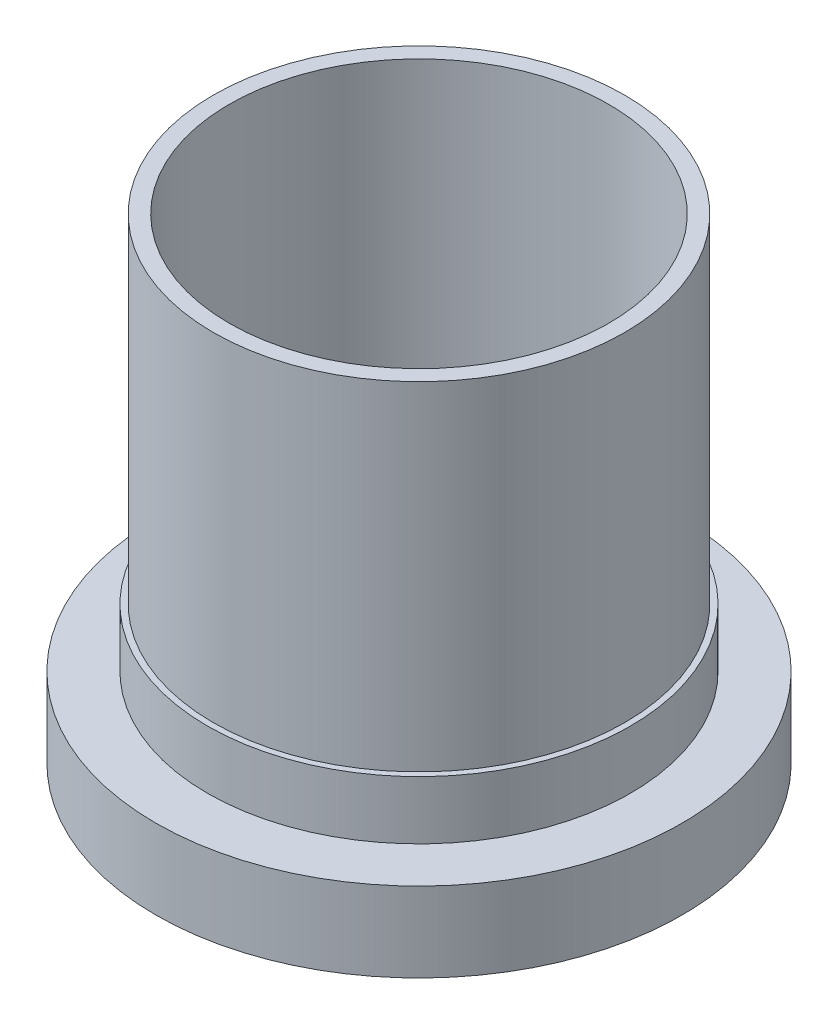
from build123d import *


with BuildPart() as part:
    # Esquisse1 → R_volution1 (revolve)
    with BuildSketch(Plane.XY, mode=Mode.PRIVATE) as r_volution1_sk:
        with BuildLine():
            Line((-119.8522756, 152.126831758), (-119.8522756, 54.612290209))
            ThreePointArc((-119.8522756, 54.612290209), (-118.789460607, 49.67488359), (-115.789278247, 45.612068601))
            Line((-115.789278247, 45.612068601), (-109.0022756, 39.626831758))
            Line((-109.0022756, 39.626831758), (-109.0022756, 29.626831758))
            Line((-109.0022756, 29.626831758), (-138.7522756, 29.626831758))
            Line((-138.7522756, 29.626831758), (-138.7522756, 50.126831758))
            Line((-138.7522756, 50.126831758), (-125.4522756, 50.126831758))
            Line((-125.4522756, 50.126831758), (-125.4522756, 65.126831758))
            Line((-125.4522756, 65.126831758), (-123.9522756, 65.126831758))
            Line((-123.9522756, 65.126831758), (-123.9522756, 152.126831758))
            Line((-123.9522756, 152.126831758), (-119.8522756, 152.126831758))
        make_face()
    revolve(r_volution1_sk.sketch.rotate(Axis((-71.0022756, 158.736724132, 0), (0, -1, 0)), 270), axis=Axis((-71.0022756, 158.736724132, 0), (0, -1, 0)))


solid = part.part
